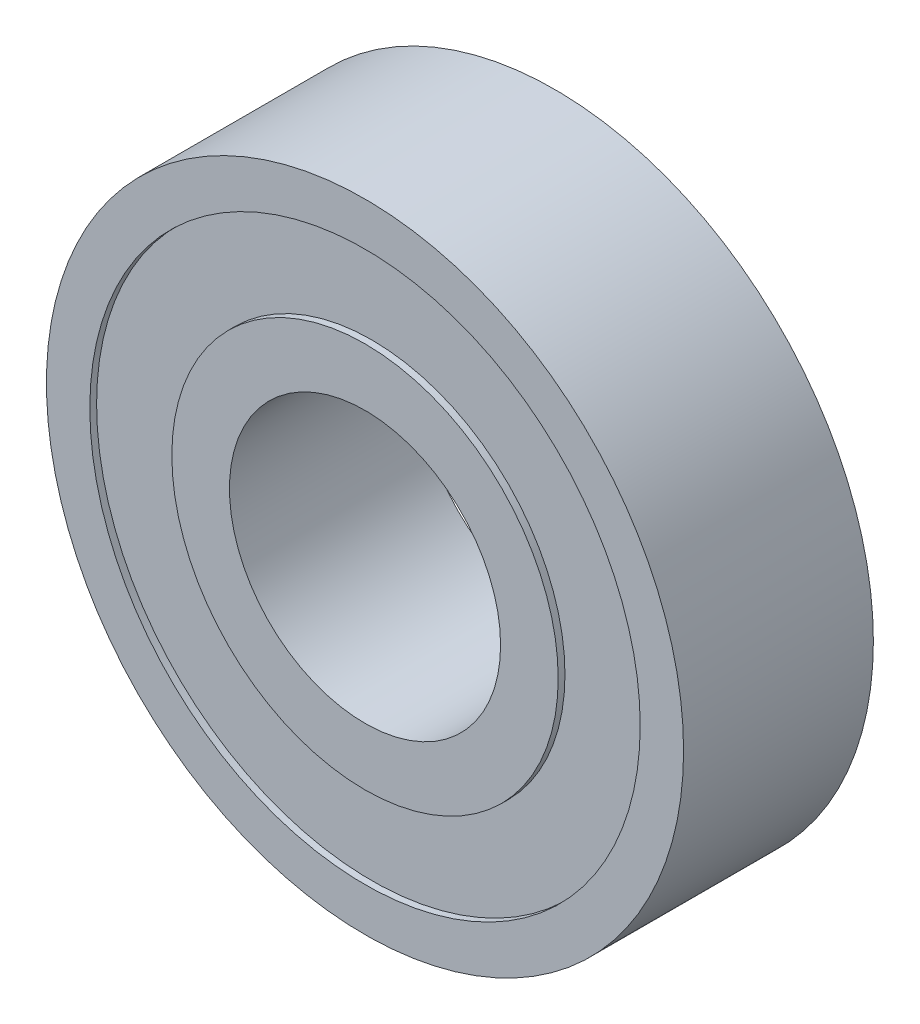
ISO-10303-21;
HEADER;
FILE_DESCRIPTION(('STEP AP214'),'2;1');
FILE_NAME('part.step','',(''),(''),'','','');
FILE_SCHEMA(('AUTOMOTIVE_DESIGN { 1 0 10303 214 1 1 1 1 }'));
ENDSEC;
DATA;
#1=APPLICATION_CONTEXT('core data for automotive mechanical design processes');
#2=APPLICATION_PROTOCOL_DEFINITION('international standard','automotive_design',2000,#1);
#3=PRODUCT_CONTEXT('',#1,'mechanical');
#4=PRODUCT('Part','Part','',(#3));
#5=PRODUCT_RELATED_PRODUCT_CATEGORY('part','',(#4));
#6=PRODUCT_DEFINITION_FORMATION('','',#4);
#7=PRODUCT_DEFINITION_CONTEXT('part definition',#1,'design');
#8=PRODUCT_DEFINITION('design','',#6,#7);
#9=PRODUCT_DEFINITION_SHAPE('','',#8);
#10=(LENGTH_UNIT() NAMED_UNIT(*) SI_UNIT(.MILLI.,.METRE.));
#11=(NAMED_UNIT(*) PLANE_ANGLE_UNIT() SI_UNIT($,.RADIAN.));
#12=(NAMED_UNIT(*) SI_UNIT($,.STERADIAN.) SOLID_ANGLE_UNIT());
#13=UNCERTAINTY_MEASURE_WITH_UNIT(LENGTH_MEASURE(1.E-05),#10,'distance_accuracy_value','');
#14=(GEOMETRIC_REPRESENTATION_CONTEXT(3) GLOBAL_UNCERTAINTY_ASSIGNED_CONTEXT((#13)) GLOBAL_UNIT_ASSIGNED_CONTEXT((#10,
#11,#12)) REPRESENTATION_CONTEXT('',''));
#15=CARTESIAN_POINT('',(0.,0.,0.));
#16=DIRECTION('',(0.,0.,1.));
#17=DIRECTION('',(1.,0.,0.));
#18=AXIS2_PLACEMENT_3D('',#15,#16,#17);
#19=CARTESIAN_POINT('',(0.,0.,-7.00000000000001));
#20=DIRECTION('',(0.,0.,1.));
#21=DIRECTION('',(1.,0.,0.));
#22=AXIS2_PLACEMENT_3D('',#19,#20,#21);
#23=PLANE('',#22);
#24=CARTESIAN_POINT('',(0.,0.,-7.00000000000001));
#25=DIRECTION('',(0.,0.,1.));
#26=DIRECTION('',(1.,0.,0.));
#27=AXIS2_PLACEMENT_3D('',#24,#25,#26);
#28=CIRCLE('',#27,23.5);
#29=CARTESIAN_POINT('',(23.5,0.,-7.00000000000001));
#30=VERTEX_POINT('',#29);
#31=EDGE_CURVE('E46',#30,#30,#28,.T.);
#32=ORIENTED_EDGE('',*,*,#31,.F.);
#33=EDGE_LOOP('',(#32));
#34=FACE_BOUND('',#33,.T.);
#35=CARTESIAN_POINT('',(0.,0.,-7.00000000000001));
#36=DIRECTION('',(0.,0.,1.));
#37=DIRECTION('',(1.,0.,0.));
#38=AXIS2_PLACEMENT_3D('',#35,#36,#37);
#39=CIRCLE('',#38,20.3);
#40=CARTESIAN_POINT('',(20.3,0.,-7.00000000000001));
#41=VERTEX_POINT('',#40);
#42=EDGE_CURVE('E83',#41,#41,#39,.T.);
#43=ORIENTED_EDGE('',*,*,#42,.T.);
#44=EDGE_LOOP('',(#43));
#45=FACE_BOUND('',#44,.T.);
#46=ADVANCED_FACE('F38',(#34,#45),#23,.F.);
#47=CARTESIAN_POINT('',(0.,0.,7.00000000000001));
#48=DIRECTION('',(0.,0.,1.));
#49=DIRECTION('',(1.,0.,0.));
#50=AXIS2_PLACEMENT_3D('',#47,#48,#49);
#51=PLANE('',#50);
#52=CARTESIAN_POINT('',(0.,0.,7.00000000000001));
#53=DIRECTION('',(0.,0.,1.));
#54=DIRECTION('',(1.,0.,0.));
#55=AXIS2_PLACEMENT_3D('',#52,#53,#54);
#56=CIRCLE('',#55,10.);
#57=CARTESIAN_POINT('',(10.,0.,7.00000000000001));
#58=VERTEX_POINT('',#57);
#59=EDGE_CURVE('E53',#58,#58,#56,.T.);
#60=ORIENTED_EDGE('',*,*,#59,.F.);
#61=EDGE_LOOP('',(#60));
#62=FACE_BOUND('',#61,.T.);
#63=CARTESIAN_POINT('',(0.,0.,7.00000000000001));
#64=DIRECTION('',(0.,0.,1.));
#65=DIRECTION('',(1.,0.,0.));
#66=AXIS2_PLACEMENT_3D('',#63,#64,#65);
#67=CIRCLE('',#66,14.25);
#68=CARTESIAN_POINT('',(14.25,0.,7.00000000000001));
#69=VERTEX_POINT('',#68);
#70=EDGE_CURVE('E75',#69,#69,#67,.T.);
#71=ORIENTED_EDGE('',*,*,#70,.T.);
#72=EDGE_LOOP('',(#71));
#73=FACE_BOUND('',#72,.T.);
#74=ADVANCED_FACE('F118',(#62,#73),#51,.T.);
#75=CARTESIAN_POINT('',(0.,0.,7.00000000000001));
#76=DIRECTION('',(0.,0.,1.));
#77=DIRECTION('',(1.,0.,0.));
#78=AXIS2_PLACEMENT_3D('',#75,#76,#77);
#79=CIRCLE('',#78,20.3);
#80=CARTESIAN_POINT('',(20.3,0.,7.00000000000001));
#81=VERTEX_POINT('',#80);
#82=EDGE_CURVE('E69',#81,#81,#79,.T.);
#83=ORIENTED_EDGE('',*,*,#82,.F.);
#84=EDGE_LOOP('',(#83));
#85=FACE_BOUND('',#84,.T.);
#86=CARTESIAN_POINT('',(0.,0.,7.00000000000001));
#87=DIRECTION('',(0.,0.,1.));
#88=DIRECTION('',(1.,0.,0.));
#89=AXIS2_PLACEMENT_3D('',#86,#87,#88);
#90=CIRCLE('',#89,23.5);
#91=CARTESIAN_POINT('',(23.5,0.,7.00000000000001));
#92=VERTEX_POINT('',#91);
#93=EDGE_CURVE('E10',#92,#92,#90,.T.);
#94=ORIENTED_EDGE('',*,*,#93,.T.);
#95=EDGE_LOOP('',(#94));
#96=FACE_BOUND('',#95,.T.);
#97=ADVANCED_FACE('F100',(#85,#96),#51,.T.);
#98=CARTESIAN_POINT('',(0.,0.,-7.00000000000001));
#99=DIRECTION('',(0.,0.,1.));
#100=DIRECTION('',(1.,0.,0.));
#101=AXIS2_PLACEMENT_3D('',#98,#99,#100);
#102=CIRCLE('',#101,14.25);
#103=CARTESIAN_POINT('',(14.25,0.,-7.00000000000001));
#104=VERTEX_POINT('',#103);
#105=EDGE_CURVE('E90',#104,#104,#102,.T.);
#106=ORIENTED_EDGE('',*,*,#105,.F.);
#107=EDGE_LOOP('',(#106));
#108=FACE_BOUND('',#107,.T.);
#109=CARTESIAN_POINT('',(0.,0.,-7.00000000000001));
#110=DIRECTION('',(0.,0.,1.));
#111=DIRECTION('',(1.,0.,0.));
#112=AXIS2_PLACEMENT_3D('',#109,#110,#111);
#113=CIRCLE('',#112,10.);
#114=CARTESIAN_POINT('',(10.,0.,-7.00000000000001));
#115=VERTEX_POINT('',#114);
#116=EDGE_CURVE('E60',#115,#115,#113,.T.);
#117=ORIENTED_EDGE('',*,*,#116,.T.);
#118=EDGE_LOOP('',(#117));
#119=FACE_BOUND('',#118,.T.);
#120=ADVANCED_FACE('F97',(#108,#119),#23,.F.);
#121=CARTESIAN_POINT('',(0.,0.,7.00000000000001));
#122=DIRECTION('',(0.,0.,-1.));
#123=DIRECTION('',(-1.,0.,0.));
#124=AXIS2_PLACEMENT_3D('',#121,#122,#123);
#125=CYLINDRICAL_SURFACE('',#124,23.5);
#126=ORIENTED_EDGE('',*,*,#93,.F.);
#127=EDGE_LOOP('',(#126));
#128=FACE_BOUND('',#127,.T.);
#129=ORIENTED_EDGE('',*,*,#31,.T.);
#130=EDGE_LOOP('',(#129));
#131=FACE_BOUND('',#130,.T.);
#132=ADVANCED_FACE('F40',(#128,#131),#125,.T.);
#133=CARTESIAN_POINT('',(0.,0.,7.00000000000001));
#134=DIRECTION('',(0.,0.,-1.));
#135=DIRECTION('',(-1.,0.,0.));
#136=AXIS2_PLACEMENT_3D('',#133,#134,#135);
#137=CYLINDRICAL_SURFACE('',#136,10.);
#138=ORIENTED_EDGE('',*,*,#59,.T.);
#139=EDGE_LOOP('',(#138));
#140=FACE_BOUND('',#139,.T.);
#141=ORIENTED_EDGE('',*,*,#116,.F.);
#142=EDGE_LOOP('',(#141));
#143=FACE_BOUND('',#142,.T.);
#144=ADVANCED_FACE('F104',(#140,#143),#137,.F.);
#145=CARTESIAN_POINT('',(0.,0.,6.49999999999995));
#146=DIRECTION('',(0.,0.,1.));
#147=DIRECTION('',(1.,0.,0.));
#148=AXIS2_PLACEMENT_3D('',#145,#146,#147);
#149=CYLINDRICAL_SURFACE('',#148,20.3);
#150=CARTESIAN_POINT('',(0.,0.,6.49999999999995));
#151=DIRECTION('',(0.,0.,1.));
#152=DIRECTION('',(1.,0.,0.));
#153=AXIS2_PLACEMENT_3D('',#150,#151,#152);
#154=CIRCLE('',#153,20.3);
#155=CARTESIAN_POINT('',(20.3,0.,6.49999999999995));
#156=VERTEX_POINT('',#155);
#157=EDGE_CURVE('E65',#156,#156,#154,.T.);
#158=ORIENTED_EDGE('',*,*,#157,.F.);
#159=EDGE_LOOP('',(#158));
#160=FACE_BOUND('',#159,.T.);
#161=ORIENTED_EDGE('',*,*,#82,.T.);
#162=EDGE_LOOP('',(#161));
#163=FACE_BOUND('',#162,.T.);
#164=ADVANCED_FACE('F106',(#160,#163),#149,.F.);
#165=CARTESIAN_POINT('',(0.,0.,6.49999999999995));
#166=DIRECTION('',(0.,0.,1.));
#167=DIRECTION('',(1.,0.,0.));
#168=AXIS2_PLACEMENT_3D('',#165,#166,#167);
#169=PLANE('',#168);
#170=CARTESIAN_POINT('',(0.,0.,6.49999999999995));
#171=DIRECTION('',(0.,0.,1.));
#172=DIRECTION('',(1.,0.,0.));
#173=AXIS2_PLACEMENT_3D('',#170,#171,#172);
#174=CIRCLE('',#173,14.25);
#175=CARTESIAN_POINT('',(14.25,0.,6.49999999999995));
#176=VERTEX_POINT('',#175);
#177=EDGE_CURVE('E72',#176,#176,#174,.T.);
#178=ORIENTED_EDGE('',*,*,#177,.F.);
#179=EDGE_LOOP('',(#178));
#180=FACE_BOUND('',#179,.T.);
#181=ORIENTED_EDGE('',*,*,#157,.T.);
#182=EDGE_LOOP('',(#181));
#183=FACE_BOUND('',#182,.T.);
#184=ADVANCED_FACE('F113',(#180,#183),#169,.T.);
#185=CARTESIAN_POINT('',(0.,0.,6.49999999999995));
#186=DIRECTION('',(0.,0.,1.));
#187=DIRECTION('',(1.,0.,0.));
#188=AXIS2_PLACEMENT_3D('',#185,#186,#187);
#189=CYLINDRICAL_SURFACE('',#188,14.25);
#190=ORIENTED_EDGE('',*,*,#177,.T.);
#191=EDGE_LOOP('',(#190));
#192=FACE_BOUND('',#191,.T.);
#193=ORIENTED_EDGE('',*,*,#70,.F.);
#194=EDGE_LOOP('',(#193));
#195=FACE_BOUND('',#194,.T.);
#196=ADVANCED_FACE('F154',(#192,#195),#189,.T.);
#197=CARTESIAN_POINT('',(0.,0.,-6.49999999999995));
#198=DIRECTION('',(0.,0.,-1.));
#199=DIRECTION('',(1.,0.,0.));
#200=AXIS2_PLACEMENT_3D('',#197,#198,#199);
#201=PLANE('',#200);
#202=CARTESIAN_POINT('',(0.,0.,-6.49999999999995));
#203=DIRECTION('',(0.,0.,1.));
#204=DIRECTION('',(1.,0.,0.));
#205=AXIS2_PLACEMENT_3D('',#202,#203,#204);
#206=CIRCLE('',#205,20.3);
#207=CARTESIAN_POINT('',(20.3,0.,-6.49999999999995));
#208=VERTEX_POINT('',#207);
#209=EDGE_CURVE('E79',#208,#208,#206,.T.);
#210=ORIENTED_EDGE('',*,*,#209,.F.);
#211=EDGE_LOOP('',(#210));
#212=FACE_BOUND('',#211,.T.);
#213=CARTESIAN_POINT('',(0.,0.,-6.49999999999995));
#214=DIRECTION('',(0.,0.,1.));
#215=DIRECTION('',(1.,0.,0.));
#216=AXIS2_PLACEMENT_3D('',#213,#214,#215);
#217=CIRCLE('',#216,14.25);
#218=CARTESIAN_POINT('',(14.25,0.,-6.49999999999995));
#219=VERTEX_POINT('',#218);
#220=EDGE_CURVE('E87',#219,#219,#217,.T.);
#221=ORIENTED_EDGE('',*,*,#220,.T.);
#222=EDGE_LOOP('',(#221));
#223=FACE_BOUND('',#222,.T.);
#224=ADVANCED_FACE('F163',(#212,#223),#201,.T.);
#225=CARTESIAN_POINT('',(0.,0.,-6.49999999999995));
#226=DIRECTION('',(0.,0.,-1.));
#227=DIRECTION('',(-1.,0.,0.));
#228=AXIS2_PLACEMENT_3D('',#225,#226,#227);
#229=CYLINDRICAL_SURFACE('',#228,20.3);
#230=ORIENTED_EDGE('',*,*,#209,.T.);
#231=EDGE_LOOP('',(#230));
#232=FACE_BOUND('',#231,.T.);
#233=ORIENTED_EDGE('',*,*,#42,.F.);
#234=EDGE_LOOP('',(#233));
#235=FACE_BOUND('',#234,.T.);
#236=ADVANCED_FACE('F172',(#232,#235),#229,.F.);
#237=CARTESIAN_POINT('',(0.,0.,-6.49999999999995));
#238=DIRECTION('',(0.,0.,-1.));
#239=DIRECTION('',(-1.,0.,0.));
#240=AXIS2_PLACEMENT_3D('',#237,#238,#239);
#241=CYLINDRICAL_SURFACE('',#240,14.25);
#242=ORIENTED_EDGE('',*,*,#220,.F.);
#243=EDGE_LOOP('',(#242));
#244=FACE_BOUND('',#243,.T.);
#245=ORIENTED_EDGE('',*,*,#105,.T.);
#246=EDGE_LOOP('',(#245));
#247=FACE_BOUND('',#246,.T.);
#248=ADVANCED_FACE('F95',(#244,#247),#241,.T.);
#249=CLOSED_SHELL('',(#46,#74,#97,#120,#132,#144,#164,#184,#196,#224,#236,#248));
#250=MANIFOLD_SOLID_BREP('B2',#249);
#251=ADVANCED_BREP_SHAPE_REPRESENTATION('',(#18,#250),#14);
#252=SHAPE_DEFINITION_REPRESENTATION(#9,#251);
ENDSEC;
END-ISO-10303-21;
